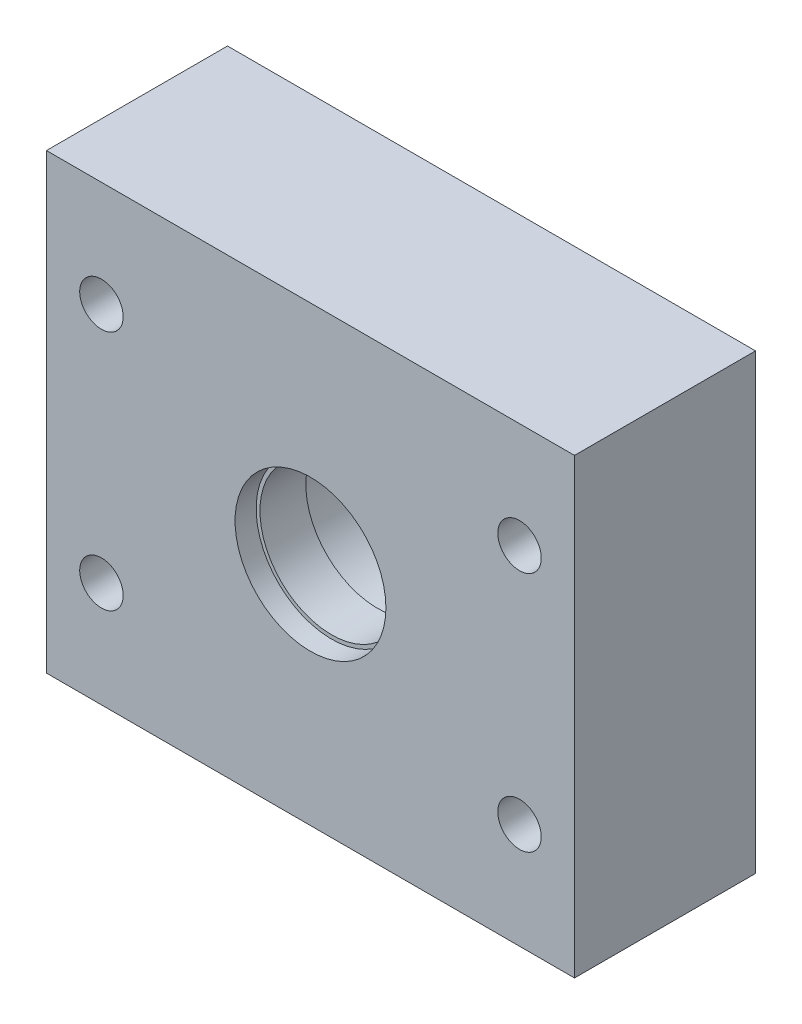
ISO-10303-21;
HEADER;
FILE_DESCRIPTION(('STEP AP214'),'2;1');
FILE_NAME('part.step','',(''),(''),'','','');
FILE_SCHEMA(('AUTOMOTIVE_DESIGN { 1 0 10303 214 1 1 1 1 }'));
ENDSEC;
DATA;
#1=APPLICATION_CONTEXT('core data for automotive mechanical design processes');
#2=APPLICATION_PROTOCOL_DEFINITION('international standard','automotive_design',2000,#1);
#3=PRODUCT_CONTEXT('',#1,'mechanical');
#4=PRODUCT('Part','Part','',(#3));
#5=PRODUCT_RELATED_PRODUCT_CATEGORY('part','',(#4));
#6=PRODUCT_DEFINITION_FORMATION('','',#4);
#7=PRODUCT_DEFINITION_CONTEXT('part definition',#1,'design');
#8=PRODUCT_DEFINITION('design','',#6,#7);
#9=PRODUCT_DEFINITION_SHAPE('','',#8);
#10=(LENGTH_UNIT() NAMED_UNIT(*) SI_UNIT(.MILLI.,.METRE.));
#11=(NAMED_UNIT(*) PLANE_ANGLE_UNIT() SI_UNIT($,.RADIAN.));
#12=(NAMED_UNIT(*) SI_UNIT($,.STERADIAN.) SOLID_ANGLE_UNIT());
#13=UNCERTAINTY_MEASURE_WITH_UNIT(LENGTH_MEASURE(1.E-05),#10,'distance_accuracy_value','');
#14=(GEOMETRIC_REPRESENTATION_CONTEXT(3) GLOBAL_UNCERTAINTY_ASSIGNED_CONTEXT((#13)) GLOBAL_UNIT_ASSIGNED_CONTEXT((#10,
#11,#12)) REPRESENTATION_CONTEXT('',''));
#15=CARTESIAN_POINT('',(0.,0.,0.));
#16=DIRECTION('',(0.,0.,1.));
#17=DIRECTION('',(1.,0.,0.));
#18=AXIS2_PLACEMENT_3D('',#15,#16,#17);
#19=CARTESIAN_POINT('',(22.225,19.05,0.));
#20=DIRECTION('',(0.,0.,1.));
#21=DIRECTION('',(1.,0.,0.));
#22=AXIS2_PLACEMENT_3D('',#19,#20,#21);
#23=CYLINDRICAL_SURFACE('',#22,6.0325);
#24=CARTESIAN_POINT('',(22.225,19.05,13.462));
#25=DIRECTION('',(0.,0.,1.));
#26=DIRECTION('',(1.,0.,0.));
#27=AXIS2_PLACEMENT_3D('',#24,#25,#26);
#28=CIRCLE('',#27,6.0325);
#29=CARTESIAN_POINT('',(28.2575,19.05,13.462));
#30=VERTEX_POINT('',#29);
#31=EDGE_CURVE('E108',#30,#30,#28,.F.);
#32=CARTESIAN_POINT('',(22.225,19.05,9.6012));
#33=DIRECTION('',(0.,0.,-1.));
#34=DIRECTION('',(-1.,0.,0.));
#35=AXIS2_PLACEMENT_3D('',#32,#33,#34);
#36=CIRCLE('',#35,6.0325);
#37=CARTESIAN_POINT('',(28.2575,19.05,9.6012));
#38=VERTEX_POINT('',#37);
#39=EDGE_CURVE('E33',#38,#38,#36,.F.);
#40=CARTESIAN_POINT('',(28.2575,19.05,13.462));
#41=CARTESIAN_POINT('',(28.2575,19.05,13.4217833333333));
#42=CARTESIAN_POINT('',(28.2575,19.05,13.3815666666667));
#43=CARTESIAN_POINT('',(28.2575,19.05,13.3011333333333));
#44=CARTESIAN_POINT('',(28.2575,19.05,13.2609166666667));
#45=CARTESIAN_POINT('',(28.2575,19.05,13.1804833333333));
#46=CARTESIAN_POINT('',(28.2575,19.05,13.1402666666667));
#47=CARTESIAN_POINT('',(28.2575,19.05,13.0598333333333));
#48=CARTESIAN_POINT('',(28.2575,19.05,13.0196166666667));
#49=CARTESIAN_POINT('',(28.2575,19.05,12.9391833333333));
#50=CARTESIAN_POINT('',(28.2575,19.05,12.8989666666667));
#51=CARTESIAN_POINT('',(28.2575,19.05,12.8185333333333));
#52=CARTESIAN_POINT('',(28.2575,19.05,12.7783166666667));
#53=CARTESIAN_POINT('',(28.2575,19.05,12.6978833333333));
#54=CARTESIAN_POINT('',(28.2575,19.05,12.6576666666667));
#55=CARTESIAN_POINT('',(28.2575,19.05,12.5772333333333));
#56=CARTESIAN_POINT('',(28.2575,19.05,12.5370166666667));
#57=CARTESIAN_POINT('',(28.2575,19.05,12.4565833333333));
#58=CARTESIAN_POINT('',(28.2575,19.05,12.4163666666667));
#59=CARTESIAN_POINT('',(28.2575,19.05,12.3359333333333));
#60=CARTESIAN_POINT('',(28.2575,19.05,12.2957166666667));
#61=CARTESIAN_POINT('',(28.2575,19.05,12.2152833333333));
#62=CARTESIAN_POINT('',(28.2575,19.05,12.1750666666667));
#63=CARTESIAN_POINT('',(28.2575,19.05,12.0946333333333));
#64=CARTESIAN_POINT('',(28.2575,19.05,12.0544166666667));
#65=CARTESIAN_POINT('',(28.2575,19.05,11.9739833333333));
#66=CARTESIAN_POINT('',(28.2575,19.05,11.9337666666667));
#67=CARTESIAN_POINT('',(28.2575,19.05,11.8533333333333));
#68=CARTESIAN_POINT('',(28.2575,19.05,11.8131166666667));
#69=CARTESIAN_POINT('',(28.2575,19.05,11.7326833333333));
#70=CARTESIAN_POINT('',(28.2575,19.05,11.6924666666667));
#71=CARTESIAN_POINT('',(28.2575,19.05,11.6120333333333));
#72=CARTESIAN_POINT('',(28.2575,19.05,11.5718166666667));
#73=CARTESIAN_POINT('',(28.2575,19.05,11.4913833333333));
#74=CARTESIAN_POINT('',(28.2575,19.05,11.4511666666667));
#75=CARTESIAN_POINT('',(28.2575,19.05,11.3707333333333));
#76=CARTESIAN_POINT('',(28.2575,19.05,11.3305166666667));
#77=CARTESIAN_POINT('',(28.2575,19.05,11.2500833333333));
#78=CARTESIAN_POINT('',(28.2575,19.05,11.2098666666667));
#79=CARTESIAN_POINT('',(28.2575,19.05,11.1294333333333));
#80=CARTESIAN_POINT('',(28.2575,19.05,11.0892166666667));
#81=CARTESIAN_POINT('',(28.2575,19.05,11.0087833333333));
#82=CARTESIAN_POINT('',(28.2575,19.05,10.9685666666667));
#83=CARTESIAN_POINT('',(28.2575,19.05,10.8881333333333));
#84=CARTESIAN_POINT('',(28.2575,19.05,10.8479166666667));
#85=CARTESIAN_POINT('',(28.2575,19.05,10.7674833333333));
#86=CARTESIAN_POINT('',(28.2575,19.05,10.7272666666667));
#87=CARTESIAN_POINT('',(28.2575,19.05,10.6468333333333));
#88=CARTESIAN_POINT('',(28.2575,19.05,10.6066166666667));
#89=CARTESIAN_POINT('',(28.2575,19.05,10.5261833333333));
#90=CARTESIAN_POINT('',(28.2575,19.05,10.4859666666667));
#91=CARTESIAN_POINT('',(28.2575,19.05,10.4055333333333));
#92=CARTESIAN_POINT('',(28.2575,19.05,10.3653166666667));
#93=CARTESIAN_POINT('',(28.2575,19.05,10.2848833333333));
#94=CARTESIAN_POINT('',(28.2575,19.05,10.2446666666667));
#95=CARTESIAN_POINT('',(28.2575,19.05,10.1642333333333));
#96=CARTESIAN_POINT('',(28.2575,19.05,10.1240166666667));
#97=CARTESIAN_POINT('',(28.2575,19.05,10.0435833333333));
#98=CARTESIAN_POINT('',(28.2575,19.05,10.0033666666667));
#99=CARTESIAN_POINT('',(28.2575,19.05,9.92293333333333));
#100=CARTESIAN_POINT('',(28.2575,19.05,9.88271666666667));
#101=CARTESIAN_POINT('',(28.2575,19.05,9.80228333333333));
#102=CARTESIAN_POINT('',(28.2575,19.05,9.76206666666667));
#103=CARTESIAN_POINT('',(28.2575,19.05,9.68163333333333));
#104=CARTESIAN_POINT('',(28.2575,19.05,9.64141666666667));
#105=CARTESIAN_POINT('',(28.2575,19.05,9.6012));
#106=B_SPLINE_CURVE_WITH_KNOTS('',3,(#40,#41,#42,#43,#44,#45,#46,#47,#48,#49,#50,#51,#52,#53,
#54,#55,#56,#57,#58,#59,#60,#61,#62,#63,#64,#65,#66,#67,#68,#69,#70,#71,#72,#73,#74,#75,#76,#77,
#78,#79,#80,#81,#82,#83,#84,#85,#86,#87,#88,#89,#90,#91,#92,#93,#94,#95,#96,#97,#98,#99,#100,
#101,#102,#103,#104,#105),.UNSPECIFIED.,.F.,.F.,(4,2,2,2,2,2,2,2,2,2,2,2,2,2,2,2,2,2,2,2,2,2,2,
2,2,2,2,2,2,2,2,2,4),(0.,0.12065,0.2413,0.36195,0.4826,0.60325,0.7239,0.844549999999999,
0.965199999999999,1.08585,1.2065,1.32715,1.4478,1.56845,1.6891,1.80975,1.9304,2.05105,2.1717,
2.29235,2.413,2.53365,2.6543,2.77495,2.8956,3.01625,3.1369,3.25755,3.3782,3.49885,3.6195,
3.74015,3.8608),.UNSPECIFIED.);
#107=EDGE_CURVE('BSEAM29',#30,#38,#106,.T.);
#108=ORIENTED_EDGE('',*,*,#31,.F.);
#109=ORIENTED_EDGE('',*,*,#39,.F.);
#110=ORIENTED_EDGE('',*,*,#107,.T.);
#111=ORIENTED_EDGE('',*,*,#107,.F.);
#112=EDGE_LOOP('',(#108,#110,#109,#111));
#113=FACE_BOUND('',#112,.T.);
#114=ADVANCED_FACE('F29',(#113),#23,.F.);
#115=CARTESIAN_POINT('',(0.,0.,15.24));
#116=DIRECTION('',(1.,0.,0.));
#117=DIRECTION('',(0.,1.,0.));
#118=AXIS2_PLACEMENT_3D('',#115,#116,#117);
#119=PLANE('',#118);
#120=DIRECTION('',(0.,-1.,0.));
#121=VECTOR('',#120,1.);
#122=CARTESIAN_POINT('',(0.,0.,0.));
#123=LINE('',#122,#121);
#124=CARTESIAN_POINT('',(0.,38.1,0.));
#125=VERTEX_POINT('',#124);
#126=CARTESIAN_POINT('',(0.,0.,0.));
#127=VERTEX_POINT('',#126);
#128=EDGE_CURVE('E76',#125,#127,#123,.T.);
#129=ORIENTED_EDGE('',*,*,#128,.T.);
#130=DIRECTION('',(0.,0.,-1.));
#131=VECTOR('',#130,1.);
#132=CARTESIAN_POINT('',(0.,0.,15.24));
#133=LINE('',#132,#131);
#134=CARTESIAN_POINT('',(0.,0.,15.24));
#135=VERTEX_POINT('',#134);
#136=EDGE_CURVE('E11',#135,#127,#133,.T.);
#137=ORIENTED_EDGE('',*,*,#136,.F.);
#138=DIRECTION('',(0.,-1.,0.));
#139=VECTOR('',#138,1.);
#140=CARTESIAN_POINT('',(0.,0.,15.24));
#141=LINE('',#140,#139);
#142=CARTESIAN_POINT('',(0.,38.1,15.24));
#143=VERTEX_POINT('',#142);
#144=EDGE_CURVE('E99',#143,#135,#141,.T.);
#145=ORIENTED_EDGE('',*,*,#144,.F.);
#146=DIRECTION('',(0.,0.,-1.));
#147=VECTOR('',#146,1.);
#148=CARTESIAN_POINT('',(0.,38.1,15.24));
#149=LINE('',#148,#147);
#150=EDGE_CURVE('E88',#143,#125,#149,.T.);
#151=ORIENTED_EDGE('',*,*,#150,.T.);
#152=EDGE_LOOP('',(#129,#137,#145,#151));
#153=FACE_BOUND('',#152,.T.);
#154=ADVANCED_FACE('F31',(#153),#119,.F.);
#155=CARTESIAN_POINT('',(0.,0.,15.24));
#156=DIRECTION('',(0.,1.,0.));
#157=DIRECTION('',(0.,0.,1.));
#158=AXIS2_PLACEMENT_3D('',#155,#156,#157);
#159=PLANE('',#158);
#160=DIRECTION('',(1.,0.,0.));
#161=VECTOR('',#160,1.);
#162=CARTESIAN_POINT('',(0.,0.,0.));
#163=LINE('',#162,#161);
#164=CARTESIAN_POINT('',(44.45,0.,0.));
#165=VERTEX_POINT('',#164);
#166=EDGE_CURVE('E72',#127,#165,#163,.T.);
#167=ORIENTED_EDGE('',*,*,#166,.T.);
#168=DIRECTION('',(0.,0.,-1.));
#169=VECTOR('',#168,1.);
#170=CARTESIAN_POINT('',(44.45,0.,15.24));
#171=LINE('',#170,#169);
#172=CARTESIAN_POINT('',(44.45,0.,15.24));
#173=VERTEX_POINT('',#172);
#174=EDGE_CURVE('E38',#173,#165,#171,.T.);
#175=ORIENTED_EDGE('',*,*,#174,.F.);
#176=DIRECTION('',(1.,0.,0.));
#177=VECTOR('',#176,1.);
#178=CARTESIAN_POINT('',(0.,0.,15.24));
#179=LINE('',#178,#177);
#180=EDGE_CURVE('E84',#135,#173,#179,.T.);
#181=ORIENTED_EDGE('',*,*,#180,.F.);
#182=ORIENTED_EDGE('',*,*,#136,.T.);
#183=EDGE_LOOP('',(#167,#175,#181,#182));
#184=FACE_BOUND('',#183,.T.);
#185=ADVANCED_FACE('F83',(#184),#159,.F.);
#186=CARTESIAN_POINT('',(44.45,0.,15.24));
#187=DIRECTION('',(-1.,0.,0.));
#188=DIRECTION('',(0.,-1.,0.));
#189=AXIS2_PLACEMENT_3D('',#186,#187,#188);
#190=PLANE('',#189);
#191=DIRECTION('',(0.,1.,0.));
#192=VECTOR('',#191,1.);
#193=CARTESIAN_POINT('',(44.45,0.,0.));
#194=LINE('',#193,#192);
#195=CARTESIAN_POINT('',(44.45,38.1,0.));
#196=VERTEX_POINT('',#195);
#197=EDGE_CURVE('E77',#165,#196,#194,.T.);
#198=ORIENTED_EDGE('',*,*,#197,.T.);
#199=DIRECTION('',(0.,0.,-1.));
#200=VECTOR('',#199,1.);
#201=CARTESIAN_POINT('',(44.45,38.1,15.24));
#202=LINE('',#201,#200);
#203=CARTESIAN_POINT('',(44.45,38.1,15.24));
#204=VERTEX_POINT('',#203);
#205=EDGE_CURVE('E105',#204,#196,#202,.T.);
#206=ORIENTED_EDGE('',*,*,#205,.F.);
#207=DIRECTION('',(0.,1.,0.));
#208=VECTOR('',#207,1.);
#209=CARTESIAN_POINT('',(44.45,0.,15.24));
#210=LINE('',#209,#208);
#211=EDGE_CURVE('E51',#173,#204,#210,.T.);
#212=ORIENTED_EDGE('',*,*,#211,.F.);
#213=ORIENTED_EDGE('',*,*,#174,.T.);
#214=EDGE_LOOP('',(#198,#206,#212,#213));
#215=FACE_BOUND('',#214,.T.);
#216=ADVANCED_FACE('F150',(#215),#190,.F.);
#217=CARTESIAN_POINT('',(0.,38.1,15.24));
#218=DIRECTION('',(0.,-1.,0.));
#219=DIRECTION('',(0.,0.,-1.));
#220=AXIS2_PLACEMENT_3D('',#217,#218,#219);
#221=PLANE('',#220);
#222=DIRECTION('',(-1.,0.,0.));
#223=VECTOR('',#222,1.);
#224=CARTESIAN_POINT('',(0.,38.1,0.));
#225=LINE('',#224,#223);
#226=EDGE_CURVE('E97',#196,#125,#225,.T.);
#227=ORIENTED_EDGE('',*,*,#226,.T.);
#228=ORIENTED_EDGE('',*,*,#150,.F.);
#229=DIRECTION('',(-1.,0.,0.));
#230=VECTOR('',#229,1.);
#231=CARTESIAN_POINT('',(0.,38.1,15.24));
#232=LINE('',#231,#230);
#233=EDGE_CURVE('E46',#204,#143,#232,.T.);
#234=ORIENTED_EDGE('',*,*,#233,.F.);
#235=ORIENTED_EDGE('',*,*,#205,.T.);
#236=EDGE_LOOP('',(#227,#228,#234,#235));
#237=FACE_BOUND('',#236,.T.);
#238=ADVANCED_FACE('F146',(#237),#221,.F.);
#239=CARTESIAN_POINT('',(0.,38.1,15.24));
#240=DIRECTION('',(0.,0.,-1.));
#241=DIRECTION('',(-1.,0.,0.));
#242=AXIS2_PLACEMENT_3D('',#239,#240,#241);
#243=PLANE('',#242);
#244=CARTESIAN_POINT('',(22.225,19.05,15.24));
#245=DIRECTION('',(0.,0.,1.));
#246=DIRECTION('',(1.,0.,0.));
#247=AXIS2_PLACEMENT_3D('',#244,#245,#246);
#248=CIRCLE('',#247,6.35);
#249=CARTESIAN_POINT('',(28.575,19.05,15.24));
#250=VERTEX_POINT('',#249);
#251=EDGE_CURVE('E118',#250,#250,#248,.T.);
#252=ORIENTED_EDGE('',*,*,#251,.F.);
#253=EDGE_LOOP('',(#252));
#254=FACE_BOUND('',#253,.T.);
#255=CARTESIAN_POINT('',(39.8226362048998,8.88999999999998,15.24));
#256=DIRECTION('',(0.,0.,1.));
#257=DIRECTION('',(1.,0.,0.));
#258=AXIS2_PLACEMENT_3D('',#255,#256,#257);
#259=CIRCLE('',#258,1.8288);
#260=CARTESIAN_POINT('',(41.6514362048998,8.88999999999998,15.24));
#261=VERTEX_POINT('',#260);
#262=EDGE_CURVE('E110',#261,#261,#259,.T.);
#263=ORIENTED_EDGE('',*,*,#262,.F.);
#264=EDGE_LOOP('',(#263));
#265=FACE_BOUND('',#264,.T.);
#266=CARTESIAN_POINT('',(39.8226362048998,29.21,15.24));
#267=DIRECTION('',(0.,0.,1.));
#268=DIRECTION('',(1.,0.,0.));
#269=AXIS2_PLACEMENT_3D('',#266,#267,#268);
#270=CIRCLE('',#269,1.8288);
#271=CARTESIAN_POINT('',(41.6514362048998,29.21,15.24));
#272=VERTEX_POINT('',#271);
#273=EDGE_CURVE('E128',#272,#272,#270,.T.);
#274=ORIENTED_EDGE('',*,*,#273,.F.);
#275=EDGE_LOOP('',(#274));
#276=FACE_BOUND('',#275,.T.);
#277=CARTESIAN_POINT('',(4.62736379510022,29.21,15.24));
#278=DIRECTION('',(0.,0.,1.));
#279=DIRECTION('',(1.,0.,0.));
#280=AXIS2_PLACEMENT_3D('',#277,#278,#279);
#281=CIRCLE('',#280,1.8288);
#282=CARTESIAN_POINT('',(6.45616379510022,29.21,15.24));
#283=VERTEX_POINT('',#282);
#284=EDGE_CURVE('E134',#283,#283,#281,.T.);
#285=ORIENTED_EDGE('',*,*,#284,.F.);
#286=EDGE_LOOP('',(#285));
#287=FACE_BOUND('',#286,.T.);
#288=CARTESIAN_POINT('',(4.62736379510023,8.88999999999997,15.24));
#289=DIRECTION('',(0.,0.,1.));
#290=DIRECTION('',(1.,0.,0.));
#291=AXIS2_PLACEMENT_3D('',#288,#289,#290);
#292=CIRCLE('',#291,1.8288);
#293=CARTESIAN_POINT('',(6.45616379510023,8.88999999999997,15.24));
#294=VERTEX_POINT('',#293);
#295=EDGE_CURVE('E92',#294,#294,#292,.T.);
#296=ORIENTED_EDGE('',*,*,#295,.F.);
#297=EDGE_LOOP('',(#296));
#298=FACE_BOUND('',#297,.T.);
#299=ORIENTED_EDGE('',*,*,#144,.T.);
#300=ORIENTED_EDGE('',*,*,#180,.T.);
#301=ORIENTED_EDGE('',*,*,#211,.T.);
#302=ORIENTED_EDGE('',*,*,#233,.T.);
#303=EDGE_LOOP('',(#299,#300,#301,#302));
#304=FACE_BOUND('',#303,.T.);
#305=ADVANCED_FACE('F144',(#254,#265,#276,#287,#298,#304),#243,.F.);
#306=CARTESIAN_POINT('',(0.,38.1,0.));
#307=DIRECTION('',(0.,0.,-1.));
#308=DIRECTION('',(-1.,0.,0.));
#309=AXIS2_PLACEMENT_3D('',#306,#307,#308);
#310=PLANE('',#309);
#311=CARTESIAN_POINT('',(22.225,19.05,0.));
#312=DIRECTION('',(0.,0.,-1.));
#313=DIRECTION('',(-1.,0.,0.));
#314=AXIS2_PLACEMENT_3D('',#311,#312,#313);
#315=CIRCLE('',#314,6.35);
#316=CARTESIAN_POINT('',(15.875,19.05,0.));
#317=VERTEX_POINT('',#316);
#318=EDGE_CURVE('E194',#317,#317,#315,.T.);
#319=ORIENTED_EDGE('',*,*,#318,.F.);
#320=EDGE_LOOP('',(#319));
#321=FACE_BOUND('',#320,.T.);
#322=CARTESIAN_POINT('',(39.8226362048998,8.88999999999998,0.));
#323=DIRECTION('',(0.,0.,1.));
#324=DIRECTION('',(1.,0.,0.));
#325=AXIS2_PLACEMENT_3D('',#322,#323,#324);
#326=CIRCLE('',#325,1.8288);
#327=CARTESIAN_POINT('',(41.6514362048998,8.88999999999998,0.));
#328=VERTEX_POINT('',#327);
#329=EDGE_CURVE('E115',#328,#328,#326,.T.);
#330=ORIENTED_EDGE('',*,*,#329,.T.);
#331=EDGE_LOOP('',(#330));
#332=FACE_BOUND('',#331,.T.);
#333=CARTESIAN_POINT('',(39.8226362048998,29.21,0.));
#334=DIRECTION('',(0.,0.,1.));
#335=DIRECTION('',(1.,0.,0.));
#336=AXIS2_PLACEMENT_3D('',#333,#334,#335);
#337=CIRCLE('',#336,1.8288);
#338=CARTESIAN_POINT('',(41.6514362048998,29.21,0.));
#339=VERTEX_POINT('',#338);
#340=EDGE_CURVE('E131',#339,#339,#337,.T.);
#341=ORIENTED_EDGE('',*,*,#340,.T.);
#342=EDGE_LOOP('',(#341));
#343=FACE_BOUND('',#342,.T.);
#344=CARTESIAN_POINT('',(4.62736379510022,29.21,0.));
#345=DIRECTION('',(0.,0.,1.));
#346=DIRECTION('',(1.,0.,0.));
#347=AXIS2_PLACEMENT_3D('',#344,#345,#346);
#348=CIRCLE('',#347,1.8288);
#349=CARTESIAN_POINT('',(6.45616379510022,29.21,0.));
#350=VERTEX_POINT('',#349);
#351=EDGE_CURVE('E137',#350,#350,#348,.T.);
#352=ORIENTED_EDGE('',*,*,#351,.T.);
#353=EDGE_LOOP('',(#352));
#354=FACE_BOUND('',#353,.T.);
#355=CARTESIAN_POINT('',(4.62736379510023,8.88999999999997,0.));
#356=DIRECTION('',(0.,0.,1.));
#357=DIRECTION('',(1.,0.,0.));
#358=AXIS2_PLACEMENT_3D('',#355,#356,#357);
#359=CIRCLE('',#358,1.8288);
#360=CARTESIAN_POINT('',(6.45616379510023,8.88999999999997,0.));
#361=VERTEX_POINT('',#360);
#362=EDGE_CURVE('E89',#361,#361,#359,.T.);
#363=ORIENTED_EDGE('',*,*,#362,.T.);
#364=EDGE_LOOP('',(#363));
#365=FACE_BOUND('',#364,.T.);
#366=ORIENTED_EDGE('',*,*,#128,.F.);
#367=ORIENTED_EDGE('',*,*,#226,.F.);
#368=ORIENTED_EDGE('',*,*,#197,.F.);
#369=ORIENTED_EDGE('',*,*,#166,.F.);
#370=EDGE_LOOP('',(#366,#367,#368,#369));
#371=FACE_BOUND('',#370,.T.);
#372=ADVANCED_FACE('F73',(#321,#332,#343,#354,#365,#371),#310,.T.);
#373=CARTESIAN_POINT('',(4.62736379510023,8.88999999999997,0.));
#374=DIRECTION('',(0.,0.,1.));
#375=DIRECTION('',(1.,0.,0.));
#376=AXIS2_PLACEMENT_3D('',#373,#374,#375);
#377=CYLINDRICAL_SURFACE('',#376,1.8288);
#378=CARTESIAN_POINT('',(6.45616379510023,8.88999999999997,0.));
#379=CARTESIAN_POINT('',(6.45616379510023,8.88999999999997,0.15875));
#380=CARTESIAN_POINT('',(6.45616379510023,8.88999999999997,0.3175));
#381=CARTESIAN_POINT('',(6.45616379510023,8.88999999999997,0.635));
#382=CARTESIAN_POINT('',(6.45616379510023,8.88999999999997,0.79375));
#383=CARTESIAN_POINT('',(6.45616379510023,8.88999999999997,1.11125));
#384=CARTESIAN_POINT('',(6.45616379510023,8.88999999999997,1.27));
#385=CARTESIAN_POINT('',(6.45616379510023,8.88999999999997,1.5875));
#386=CARTESIAN_POINT('',(6.45616379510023,8.88999999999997,1.74625));
#387=CARTESIAN_POINT('',(6.45616379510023,8.88999999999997,2.06375));
#388=CARTESIAN_POINT('',(6.45616379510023,8.88999999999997,2.2225));
#389=CARTESIAN_POINT('',(6.45616379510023,8.88999999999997,2.54));
#390=CARTESIAN_POINT('',(6.45616379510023,8.88999999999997,2.69875));
#391=CARTESIAN_POINT('',(6.45616379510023,8.88999999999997,3.01625));
#392=CARTESIAN_POINT('',(6.45616379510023,8.88999999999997,3.175));
#393=CARTESIAN_POINT('',(6.45616379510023,8.88999999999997,3.4925));
#394=CARTESIAN_POINT('',(6.45616379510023,8.88999999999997,3.65125));
#395=CARTESIAN_POINT('',(6.45616379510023,8.88999999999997,3.96875));
#396=CARTESIAN_POINT('',(6.45616379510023,8.88999999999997,4.1275));
#397=CARTESIAN_POINT('',(6.45616379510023,8.88999999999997,4.445));
#398=CARTESIAN_POINT('',(6.45616379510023,8.88999999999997,4.60375));
#399=CARTESIAN_POINT('',(6.45616379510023,8.88999999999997,4.92125));
#400=CARTESIAN_POINT('',(6.45616379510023,8.88999999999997,5.08));
#401=CARTESIAN_POINT('',(6.45616379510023,8.88999999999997,5.3975));
#402=CARTESIAN_POINT('',(6.45616379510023,8.88999999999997,5.55625));
#403=CARTESIAN_POINT('',(6.45616379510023,8.88999999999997,5.87375));
#404=CARTESIAN_POINT('',(6.45616379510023,8.88999999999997,6.0325));
#405=CARTESIAN_POINT('',(6.45616379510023,8.88999999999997,6.35));
#406=CARTESIAN_POINT('',(6.45616379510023,8.88999999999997,6.50875));
#407=CARTESIAN_POINT('',(6.45616379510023,8.88999999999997,6.82625));
#408=CARTESIAN_POINT('',(6.45616379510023,8.88999999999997,6.985));
#409=CARTESIAN_POINT('',(6.45616379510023,8.88999999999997,7.3025));
#410=CARTESIAN_POINT('',(6.45616379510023,8.88999999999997,7.46125));
#411=CARTESIAN_POINT('',(6.45616379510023,8.88999999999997,7.77875));
#412=CARTESIAN_POINT('',(6.45616379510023,8.88999999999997,7.9375));
#413=CARTESIAN_POINT('',(6.45616379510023,8.88999999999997,8.255));
#414=CARTESIAN_POINT('',(6.45616379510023,8.88999999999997,8.41375));
#415=CARTESIAN_POINT('',(6.45616379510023,8.88999999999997,8.73125));
#416=CARTESIAN_POINT('',(6.45616379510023,8.88999999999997,8.89));
#417=CARTESIAN_POINT('',(6.45616379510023,8.88999999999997,9.2075));
#418=CARTESIAN_POINT('',(6.45616379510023,8.88999999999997,9.36625));
#419=CARTESIAN_POINT('',(6.45616379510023,8.88999999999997,9.68375));
#420=CARTESIAN_POINT('',(6.45616379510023,8.88999999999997,9.8425));
#421=CARTESIAN_POINT('',(6.45616379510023,8.88999999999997,10.16));
#422=CARTESIAN_POINT('',(6.45616379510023,8.88999999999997,10.31875));
#423=CARTESIAN_POINT('',(6.45616379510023,8.88999999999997,10.63625));
#424=CARTESIAN_POINT('',(6.45616379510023,8.88999999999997,10.795));
#425=CARTESIAN_POINT('',(6.45616379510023,8.88999999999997,11.1125));
#426=CARTESIAN_POINT('',(6.45616379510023,8.88999999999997,11.27125));
#427=CARTESIAN_POINT('',(6.45616379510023,8.88999999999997,11.58875));
#428=CARTESIAN_POINT('',(6.45616379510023,8.88999999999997,11.7475));
#429=CARTESIAN_POINT('',(6.45616379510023,8.88999999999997,12.065));
#430=CARTESIAN_POINT('',(6.45616379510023,8.88999999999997,12.22375));
#431=CARTESIAN_POINT('',(6.45616379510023,8.88999999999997,12.54125));
#432=CARTESIAN_POINT('',(6.45616379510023,8.88999999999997,12.7));
#433=CARTESIAN_POINT('',(6.45616379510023,8.88999999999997,13.0175));
#434=CARTESIAN_POINT('',(6.45616379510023,8.88999999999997,13.17625));
#435=CARTESIAN_POINT('',(6.45616379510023,8.88999999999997,13.49375));
#436=CARTESIAN_POINT('',(6.45616379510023,8.88999999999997,13.6525));
#437=CARTESIAN_POINT('',(6.45616379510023,8.88999999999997,13.97));
#438=CARTESIAN_POINT('',(6.45616379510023,8.88999999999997,14.12875));
#439=CARTESIAN_POINT('',(6.45616379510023,8.88999999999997,14.44625));
#440=CARTESIAN_POINT('',(6.45616379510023,8.88999999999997,14.605));
#441=CARTESIAN_POINT('',(6.45616379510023,8.88999999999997,14.9225));
#442=CARTESIAN_POINT('',(6.45616379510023,8.88999999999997,15.08125));
#443=CARTESIAN_POINT('',(6.45616379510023,8.88999999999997,15.24));
#444=B_SPLINE_CURVE_WITH_KNOTS('',3,(#378,#379,#380,#381,#382,#383,#384,#385,#386,#387,#388,
#389,#390,#391,#392,#393,#394,#395,#396,#397,#398,#399,#400,#401,#402,#403,#404,#405,#406,#407,
#408,#409,#410,#411,#412,#413,#414,#415,#416,#417,#418,#419,#420,#421,#422,#423,#424,#425,#426,
#427,#428,#429,#430,#431,#432,#433,#434,#435,#436,#437,#438,#439,#440,#441,#442,#443),
.UNSPECIFIED.,.F.,.F.,(4,2,2,2,2,2,2,2,2,2,2,2,2,2,2,2,2,2,2,2,2,2,2,2,2,2,2,2,2,2,2,2,4),(0.,
0.47625,0.9525,1.42875,1.905,2.38125,2.8575,3.33375,3.81,4.28625,4.7625,5.23875,5.715,6.19125,
6.6675,7.14375,7.62,8.09625,8.5725,9.04875,9.525,10.00125,10.4775,10.95375,11.43,11.90625,
12.3825,12.85875,13.335,13.81125,14.2875,14.76375,15.24),.UNSPECIFIED.);
#445=EDGE_CURVE('BSEAM142',#361,#294,#444,.T.);
#446=ORIENTED_EDGE('',*,*,#362,.F.);
#447=ORIENTED_EDGE('',*,*,#295,.T.);
#448=ORIENTED_EDGE('',*,*,#445,.T.);
#449=ORIENTED_EDGE('',*,*,#445,.F.);
#450=EDGE_LOOP('',(#446,#448,#447,#449));
#451=FACE_BOUND('',#450,.T.);
#452=ADVANCED_FACE('F142',(#451),#377,.F.);
#453=CARTESIAN_POINT('',(4.62736379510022,29.21,0.));
#454=DIRECTION('',(0.,0.,1.));
#455=DIRECTION('',(1.,0.,0.));
#456=AXIS2_PLACEMENT_3D('',#453,#454,#455);
#457=CYLINDRICAL_SURFACE('',#456,1.8288);
#458=CARTESIAN_POINT('',(6.45616379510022,29.21,0.));
#459=CARTESIAN_POINT('',(6.45616379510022,29.21,0.15875));
#460=CARTESIAN_POINT('',(6.45616379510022,29.21,0.3175));
#461=CARTESIAN_POINT('',(6.45616379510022,29.21,0.635));
#462=CARTESIAN_POINT('',(6.45616379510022,29.21,0.79375));
#463=CARTESIAN_POINT('',(6.45616379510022,29.21,1.11125));
#464=CARTESIAN_POINT('',(6.45616379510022,29.21,1.27));
#465=CARTESIAN_POINT('',(6.45616379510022,29.21,1.5875));
#466=CARTESIAN_POINT('',(6.45616379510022,29.21,1.74625));
#467=CARTESIAN_POINT('',(6.45616379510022,29.21,2.06375));
#468=CARTESIAN_POINT('',(6.45616379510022,29.21,2.2225));
#469=CARTESIAN_POINT('',(6.45616379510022,29.21,2.54));
#470=CARTESIAN_POINT('',(6.45616379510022,29.21,2.69875));
#471=CARTESIAN_POINT('',(6.45616379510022,29.21,3.01625));
#472=CARTESIAN_POINT('',(6.45616379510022,29.21,3.175));
#473=CARTESIAN_POINT('',(6.45616379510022,29.21,3.4925));
#474=CARTESIAN_POINT('',(6.45616379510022,29.21,3.65125));
#475=CARTESIAN_POINT('',(6.45616379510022,29.21,3.96875));
#476=CARTESIAN_POINT('',(6.45616379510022,29.21,4.1275));
#477=CARTESIAN_POINT('',(6.45616379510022,29.21,4.445));
#478=CARTESIAN_POINT('',(6.45616379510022,29.21,4.60375));
#479=CARTESIAN_POINT('',(6.45616379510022,29.21,4.92125));
#480=CARTESIAN_POINT('',(6.45616379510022,29.21,5.08));
#481=CARTESIAN_POINT('',(6.45616379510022,29.21,5.3975));
#482=CARTESIAN_POINT('',(6.45616379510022,29.21,5.55625));
#483=CARTESIAN_POINT('',(6.45616379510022,29.21,5.87375));
#484=CARTESIAN_POINT('',(6.45616379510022,29.21,6.0325));
#485=CARTESIAN_POINT('',(6.45616379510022,29.21,6.35));
#486=CARTESIAN_POINT('',(6.45616379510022,29.21,6.50875));
#487=CARTESIAN_POINT('',(6.45616379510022,29.21,6.82625));
#488=CARTESIAN_POINT('',(6.45616379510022,29.21,6.985));
#489=CARTESIAN_POINT('',(6.45616379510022,29.21,7.3025));
#490=CARTESIAN_POINT('',(6.45616379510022,29.21,7.46125));
#491=CARTESIAN_POINT('',(6.45616379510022,29.21,7.77875));
#492=CARTESIAN_POINT('',(6.45616379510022,29.21,7.9375));
#493=CARTESIAN_POINT('',(6.45616379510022,29.21,8.255));
#494=CARTESIAN_POINT('',(6.45616379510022,29.21,8.41375));
#495=CARTESIAN_POINT('',(6.45616379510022,29.21,8.73125));
#496=CARTESIAN_POINT('',(6.45616379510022,29.21,8.89));
#497=CARTESIAN_POINT('',(6.45616379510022,29.21,9.2075));
#498=CARTESIAN_POINT('',(6.45616379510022,29.21,9.36625));
#499=CARTESIAN_POINT('',(6.45616379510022,29.21,9.68375));
#500=CARTESIAN_POINT('',(6.45616379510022,29.21,9.8425));
#501=CARTESIAN_POINT('',(6.45616379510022,29.21,10.16));
#502=CARTESIAN_POINT('',(6.45616379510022,29.21,10.31875));
#503=CARTESIAN_POINT('',(6.45616379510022,29.21,10.63625));
#504=CARTESIAN_POINT('',(6.45616379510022,29.21,10.795));
#505=CARTESIAN_POINT('',(6.45616379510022,29.21,11.1125));
#506=CARTESIAN_POINT('',(6.45616379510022,29.21,11.27125));
#507=CARTESIAN_POINT('',(6.45616379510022,29.21,11.58875));
#508=CARTESIAN_POINT('',(6.45616379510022,29.21,11.7475));
#509=CARTESIAN_POINT('',(6.45616379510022,29.21,12.065));
#510=CARTESIAN_POINT('',(6.45616379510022,29.21,12.22375));
#511=CARTESIAN_POINT('',(6.45616379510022,29.21,12.54125));
#512=CARTESIAN_POINT('',(6.45616379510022,29.21,12.7));
#513=CARTESIAN_POINT('',(6.45616379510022,29.21,13.0175));
#514=CARTESIAN_POINT('',(6.45616379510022,29.21,13.17625));
#515=CARTESIAN_POINT('',(6.45616379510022,29.21,13.49375));
#516=CARTESIAN_POINT('',(6.45616379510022,29.21,13.6525));
#517=CARTESIAN_POINT('',(6.45616379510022,29.21,13.97));
#518=CARTESIAN_POINT('',(6.45616379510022,29.21,14.12875));
#519=CARTESIAN_POINT('',(6.45616379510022,29.21,14.44625));
#520=CARTESIAN_POINT('',(6.45616379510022,29.21,14.605));
#521=CARTESIAN_POINT('',(6.45616379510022,29.21,14.9225));
#522=CARTESIAN_POINT('',(6.45616379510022,29.21,15.08125));
#523=CARTESIAN_POINT('',(6.45616379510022,29.21,15.24));
#524=B_SPLINE_CURVE_WITH_KNOTS('',3,(#458,#459,#460,#461,#462,#463,#464,#465,#466,#467,#468,
#469,#470,#471,#472,#473,#474,#475,#476,#477,#478,#479,#480,#481,#482,#483,#484,#485,#486,#487,
#488,#489,#490,#491,#492,#493,#494,#495,#496,#497,#498,#499,#500,#501,#502,#503,#504,#505,#506,
#507,#508,#509,#510,#511,#512,#513,#514,#515,#516,#517,#518,#519,#520,#521,#522,#523),
.UNSPECIFIED.,.F.,.F.,(4,2,2,2,2,2,2,2,2,2,2,2,2,2,2,2,2,2,2,2,2,2,2,2,2,2,2,2,2,2,2,2,4),(0.,
0.47625,0.9525,1.42875,1.905,2.38125,2.8575,3.33375,3.81,4.28625,4.7625,5.23875,5.715,6.19125,
6.6675,7.14375,7.62,8.09625,8.5725,9.04875,9.525,10.00125,10.4775,10.95375,11.43,11.90625,
12.3825,12.85875,13.335,13.81125,14.2875,14.76375,15.24),.UNSPECIFIED.);
#525=EDGE_CURVE('BSEAM180',#350,#283,#524,.T.);
#526=ORIENTED_EDGE('',*,*,#351,.F.);
#527=ORIENTED_EDGE('',*,*,#284,.T.);
#528=ORIENTED_EDGE('',*,*,#525,.T.);
#529=ORIENTED_EDGE('',*,*,#525,.F.);
#530=EDGE_LOOP('',(#526,#528,#527,#529));
#531=FACE_BOUND('',#530,.T.);
#532=ADVANCED_FACE('F180',(#531),#457,.F.);
#533=CARTESIAN_POINT('',(39.8226362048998,29.21,0.));
#534=DIRECTION('',(0.,0.,1.));
#535=DIRECTION('',(1.,0.,0.));
#536=AXIS2_PLACEMENT_3D('',#533,#534,#535);
#537=CYLINDRICAL_SURFACE('',#536,1.8288);
#538=CARTESIAN_POINT('',(41.6514362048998,29.21,0.));
#539=CARTESIAN_POINT('',(41.6514362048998,29.21,0.15875));
#540=CARTESIAN_POINT('',(41.6514362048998,29.21,0.3175));
#541=CARTESIAN_POINT('',(41.6514362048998,29.21,0.635));
#542=CARTESIAN_POINT('',(41.6514362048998,29.21,0.79375));
#543=CARTESIAN_POINT('',(41.6514362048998,29.21,1.11125));
#544=CARTESIAN_POINT('',(41.6514362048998,29.21,1.27));
#545=CARTESIAN_POINT('',(41.6514362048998,29.21,1.5875));
#546=CARTESIAN_POINT('',(41.6514362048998,29.21,1.74625));
#547=CARTESIAN_POINT('',(41.6514362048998,29.21,2.06375));
#548=CARTESIAN_POINT('',(41.6514362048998,29.21,2.2225));
#549=CARTESIAN_POINT('',(41.6514362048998,29.21,2.54));
#550=CARTESIAN_POINT('',(41.6514362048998,29.21,2.69875));
#551=CARTESIAN_POINT('',(41.6514362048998,29.21,3.01625));
#552=CARTESIAN_POINT('',(41.6514362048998,29.21,3.175));
#553=CARTESIAN_POINT('',(41.6514362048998,29.21,3.4925));
#554=CARTESIAN_POINT('',(41.6514362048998,29.21,3.65125));
#555=CARTESIAN_POINT('',(41.6514362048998,29.21,3.96875));
#556=CARTESIAN_POINT('',(41.6514362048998,29.21,4.1275));
#557=CARTESIAN_POINT('',(41.6514362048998,29.21,4.445));
#558=CARTESIAN_POINT('',(41.6514362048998,29.21,4.60375));
#559=CARTESIAN_POINT('',(41.6514362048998,29.21,4.92125));
#560=CARTESIAN_POINT('',(41.6514362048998,29.21,5.08));
#561=CARTESIAN_POINT('',(41.6514362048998,29.21,5.3975));
#562=CARTESIAN_POINT('',(41.6514362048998,29.21,5.55625));
#563=CARTESIAN_POINT('',(41.6514362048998,29.21,5.87375));
#564=CARTESIAN_POINT('',(41.6514362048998,29.21,6.0325));
#565=CARTESIAN_POINT('',(41.6514362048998,29.21,6.35));
#566=CARTESIAN_POINT('',(41.6514362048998,29.21,6.50875));
#567=CARTESIAN_POINT('',(41.6514362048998,29.21,6.82625));
#568=CARTESIAN_POINT('',(41.6514362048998,29.21,6.985));
#569=CARTESIAN_POINT('',(41.6514362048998,29.21,7.3025));
#570=CARTESIAN_POINT('',(41.6514362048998,29.21,7.46125));
#571=CARTESIAN_POINT('',(41.6514362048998,29.21,7.77875));
#572=CARTESIAN_POINT('',(41.6514362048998,29.21,7.9375));
#573=CARTESIAN_POINT('',(41.6514362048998,29.21,8.255));
#574=CARTESIAN_POINT('',(41.6514362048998,29.21,8.41375));
#575=CARTESIAN_POINT('',(41.6514362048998,29.21,8.73125));
#576=CARTESIAN_POINT('',(41.6514362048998,29.21,8.89));
#577=CARTESIAN_POINT('',(41.6514362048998,29.21,9.2075));
#578=CARTESIAN_POINT('',(41.6514362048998,29.21,9.36625));
#579=CARTESIAN_POINT('',(41.6514362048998,29.21,9.68375));
#580=CARTESIAN_POINT('',(41.6514362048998,29.21,9.8425));
#581=CARTESIAN_POINT('',(41.6514362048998,29.21,10.16));
#582=CARTESIAN_POINT('',(41.6514362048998,29.21,10.31875));
#583=CARTESIAN_POINT('',(41.6514362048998,29.21,10.63625));
#584=CARTESIAN_POINT('',(41.6514362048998,29.21,10.795));
#585=CARTESIAN_POINT('',(41.6514362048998,29.21,11.1125));
#586=CARTESIAN_POINT('',(41.6514362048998,29.21,11.27125));
#587=CARTESIAN_POINT('',(41.6514362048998,29.21,11.58875));
#588=CARTESIAN_POINT('',(41.6514362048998,29.21,11.7475));
#589=CARTESIAN_POINT('',(41.6514362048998,29.21,12.065));
#590=CARTESIAN_POINT('',(41.6514362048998,29.21,12.22375));
#591=CARTESIAN_POINT('',(41.6514362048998,29.21,12.54125));
#592=CARTESIAN_POINT('',(41.6514362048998,29.21,12.7));
#593=CARTESIAN_POINT('',(41.6514362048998,29.21,13.0175));
#594=CARTESIAN_POINT('',(41.6514362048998,29.21,13.17625));
#595=CARTESIAN_POINT('',(41.6514362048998,29.21,13.49375));
#596=CARTESIAN_POINT('',(41.6514362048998,29.21,13.6525));
#597=CARTESIAN_POINT('',(41.6514362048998,29.21,13.97));
#598=CARTESIAN_POINT('',(41.6514362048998,29.21,14.12875));
#599=CARTESIAN_POINT('',(41.6514362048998,29.21,14.44625));
#600=CARTESIAN_POINT('',(41.6514362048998,29.21,14.605));
#601=CARTESIAN_POINT('',(41.6514362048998,29.21,14.9225));
#602=CARTESIAN_POINT('',(41.6514362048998,29.21,15.08125));
#603=CARTESIAN_POINT('',(41.6514362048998,29.21,15.24));
#604=B_SPLINE_CURVE_WITH_KNOTS('',3,(#538,#539,#540,#541,#542,#543,#544,#545,#546,#547,#548,
#549,#550,#551,#552,#553,#554,#555,#556,#557,#558,#559,#560,#561,#562,#563,#564,#565,#566,#567,
#568,#569,#570,#571,#572,#573,#574,#575,#576,#577,#578,#579,#580,#581,#582,#583,#584,#585,#586,
#587,#588,#589,#590,#591,#592,#593,#594,#595,#596,#597,#598,#599,#600,#601,#602,#603),
.UNSPECIFIED.,.F.,.F.,(4,2,2,2,2,2,2,2,2,2,2,2,2,2,2,2,2,2,2,2,2,2,2,2,2,2,2,2,2,2,2,2,4),(0.,
0.47625,0.9525,1.42875,1.905,2.38125,2.8575,3.33375,3.81,4.28625,4.7625,5.23875,5.715,6.19125,
6.6675,7.14375,7.62,8.09625,8.5725,9.04875,9.525,10.00125,10.4775,10.95375,11.43,11.90625,
12.3825,12.85875,13.335,13.81125,14.2875,14.76375,15.24),.UNSPECIFIED.);
#605=EDGE_CURVE('BSEAM176',#339,#272,#604,.T.);
#606=ORIENTED_EDGE('',*,*,#340,.F.);
#607=ORIENTED_EDGE('',*,*,#273,.T.);
#608=ORIENTED_EDGE('',*,*,#605,.T.);
#609=ORIENTED_EDGE('',*,*,#605,.F.);
#610=EDGE_LOOP('',(#606,#608,#607,#609));
#611=FACE_BOUND('',#610,.T.);
#612=ADVANCED_FACE('F176',(#611),#537,.F.);
#613=CARTESIAN_POINT('',(39.8226362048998,8.88999999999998,0.));
#614=DIRECTION('',(0.,0.,1.));
#615=DIRECTION('',(1.,0.,0.));
#616=AXIS2_PLACEMENT_3D('',#613,#614,#615);
#617=CYLINDRICAL_SURFACE('',#616,1.8288);
#618=CARTESIAN_POINT('',(41.6514362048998,8.88999999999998,0.));
#619=CARTESIAN_POINT('',(41.6514362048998,8.88999999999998,0.15875));
#620=CARTESIAN_POINT('',(41.6514362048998,8.88999999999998,0.3175));
#621=CARTESIAN_POINT('',(41.6514362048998,8.88999999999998,0.635));
#622=CARTESIAN_POINT('',(41.6514362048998,8.88999999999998,0.79375));
#623=CARTESIAN_POINT('',(41.6514362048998,8.88999999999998,1.11125));
#624=CARTESIAN_POINT('',(41.6514362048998,8.88999999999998,1.27));
#625=CARTESIAN_POINT('',(41.6514362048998,8.88999999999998,1.5875));
#626=CARTESIAN_POINT('',(41.6514362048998,8.88999999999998,1.74625));
#627=CARTESIAN_POINT('',(41.6514362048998,8.88999999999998,2.06375));
#628=CARTESIAN_POINT('',(41.6514362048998,8.88999999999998,2.2225));
#629=CARTESIAN_POINT('',(41.6514362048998,8.88999999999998,2.54));
#630=CARTESIAN_POINT('',(41.6514362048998,8.88999999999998,2.69875));
#631=CARTESIAN_POINT('',(41.6514362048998,8.88999999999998,3.01625));
#632=CARTESIAN_POINT('',(41.6514362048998,8.88999999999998,3.175));
#633=CARTESIAN_POINT('',(41.6514362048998,8.88999999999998,3.4925));
#634=CARTESIAN_POINT('',(41.6514362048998,8.88999999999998,3.65125));
#635=CARTESIAN_POINT('',(41.6514362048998,8.88999999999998,3.96875));
#636=CARTESIAN_POINT('',(41.6514362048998,8.88999999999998,4.1275));
#637=CARTESIAN_POINT('',(41.6514362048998,8.88999999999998,4.445));
#638=CARTESIAN_POINT('',(41.6514362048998,8.88999999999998,4.60375));
#639=CARTESIAN_POINT('',(41.6514362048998,8.88999999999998,4.92125));
#640=CARTESIAN_POINT('',(41.6514362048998,8.88999999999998,5.08));
#641=CARTESIAN_POINT('',(41.6514362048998,8.88999999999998,5.3975));
#642=CARTESIAN_POINT('',(41.6514362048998,8.88999999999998,5.55625));
#643=CARTESIAN_POINT('',(41.6514362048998,8.88999999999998,5.87375));
#644=CARTESIAN_POINT('',(41.6514362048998,8.88999999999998,6.0325));
#645=CARTESIAN_POINT('',(41.6514362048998,8.88999999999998,6.35));
#646=CARTESIAN_POINT('',(41.6514362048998,8.88999999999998,6.50875));
#647=CARTESIAN_POINT('',(41.6514362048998,8.88999999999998,6.82625));
#648=CARTESIAN_POINT('',(41.6514362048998,8.88999999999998,6.985));
#649=CARTESIAN_POINT('',(41.6514362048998,8.88999999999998,7.3025));
#650=CARTESIAN_POINT('',(41.6514362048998,8.88999999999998,7.46125));
#651=CARTESIAN_POINT('',(41.6514362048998,8.88999999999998,7.77875));
#652=CARTESIAN_POINT('',(41.6514362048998,8.88999999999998,7.9375));
#653=CARTESIAN_POINT('',(41.6514362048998,8.88999999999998,8.255));
#654=CARTESIAN_POINT('',(41.6514362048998,8.88999999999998,8.41375));
#655=CARTESIAN_POINT('',(41.6514362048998,8.88999999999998,8.73125));
#656=CARTESIAN_POINT('',(41.6514362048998,8.88999999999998,8.89));
#657=CARTESIAN_POINT('',(41.6514362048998,8.88999999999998,9.2075));
#658=CARTESIAN_POINT('',(41.6514362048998,8.88999999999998,9.36625));
#659=CARTESIAN_POINT('',(41.6514362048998,8.88999999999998,9.68375));
#660=CARTESIAN_POINT('',(41.6514362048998,8.88999999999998,9.8425));
#661=CARTESIAN_POINT('',(41.6514362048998,8.88999999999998,10.16));
#662=CARTESIAN_POINT('',(41.6514362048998,8.88999999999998,10.31875));
#663=CARTESIAN_POINT('',(41.6514362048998,8.88999999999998,10.63625));
#664=CARTESIAN_POINT('',(41.6514362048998,8.88999999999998,10.795));
#665=CARTESIAN_POINT('',(41.6514362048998,8.88999999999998,11.1125));
#666=CARTESIAN_POINT('',(41.6514362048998,8.88999999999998,11.27125));
#667=CARTESIAN_POINT('',(41.6514362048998,8.88999999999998,11.58875));
#668=CARTESIAN_POINT('',(41.6514362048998,8.88999999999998,11.7475));
#669=CARTESIAN_POINT('',(41.6514362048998,8.88999999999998,12.065));
#670=CARTESIAN_POINT('',(41.6514362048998,8.88999999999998,12.22375));
#671=CARTESIAN_POINT('',(41.6514362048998,8.88999999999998,12.54125));
#672=CARTESIAN_POINT('',(41.6514362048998,8.88999999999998,12.7));
#673=CARTESIAN_POINT('',(41.6514362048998,8.88999999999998,13.0175));
#674=CARTESIAN_POINT('',(41.6514362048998,8.88999999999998,13.17625));
#675=CARTESIAN_POINT('',(41.6514362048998,8.88999999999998,13.49375));
#676=CARTESIAN_POINT('',(41.6514362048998,8.88999999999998,13.6525));
#677=CARTESIAN_POINT('',(41.6514362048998,8.88999999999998,13.97));
#678=CARTESIAN_POINT('',(41.6514362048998,8.88999999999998,14.12875));
#679=CARTESIAN_POINT('',(41.6514362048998,8.88999999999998,14.44625));
#680=CARTESIAN_POINT('',(41.6514362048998,8.88999999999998,14.605));
#681=CARTESIAN_POINT('',(41.6514362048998,8.88999999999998,14.9225));
#682=CARTESIAN_POINT('',(41.6514362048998,8.88999999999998,15.08125));
#683=CARTESIAN_POINT('',(41.6514362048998,8.88999999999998,15.24));
#684=B_SPLINE_CURVE_WITH_KNOTS('',3,(#618,#619,#620,#621,#622,#623,#624,#625,#626,#627,#628,
#629,#630,#631,#632,#633,#634,#635,#636,#637,#638,#639,#640,#641,#642,#643,#644,#645,#646,#647,
#648,#649,#650,#651,#652,#653,#654,#655,#656,#657,#658,#659,#660,#661,#662,#663,#664,#665,#666,
#667,#668,#669,#670,#671,#672,#673,#674,#675,#676,#677,#678,#679,#680,#681,#682,#683),
.UNSPECIFIED.,.F.,.F.,(4,2,2,2,2,2,2,2,2,2,2,2,2,2,2,2,2,2,2,2,2,2,2,2,2,2,2,2,2,2,2,2,4),(0.,
0.47625,0.9525,1.42875,1.905,2.38125,2.8575,3.33375,3.81,4.28625,4.7625,5.23875,5.715,6.19125,
6.6675,7.14375,7.62,8.09625,8.5725,9.04875,9.525,10.00125,10.4775,10.95375,11.43,11.90625,
12.3825,12.85875,13.335,13.81125,14.2875,14.76375,15.24),.UNSPECIFIED.);
#685=EDGE_CURVE('BSEAM172',#328,#261,#684,.T.);
#686=ORIENTED_EDGE('',*,*,#329,.F.);
#687=ORIENTED_EDGE('',*,*,#262,.T.);
#688=ORIENTED_EDGE('',*,*,#685,.T.);
#689=ORIENTED_EDGE('',*,*,#685,.F.);
#690=EDGE_LOOP('',(#686,#688,#687,#689));
#691=FACE_BOUND('',#690,.T.);
#692=ADVANCED_FACE('F172',(#691),#617,.F.);
#693=CARTESIAN_POINT('',(22.225,19.05,13.462));
#694=DIRECTION('',(0.,0.,1.));
#695=DIRECTION('',(1.,0.,0.));
#696=AXIS2_PLACEMENT_3D('',#693,#694,#695);
#697=PLANE('',#696);
#698=CARTESIAN_POINT('',(22.225,19.05,13.462));
#699=DIRECTION('',(0.,0.,1.));
#700=DIRECTION('',(1.,0.,0.));
#701=AXIS2_PLACEMENT_3D('',#698,#699,#700);
#702=CIRCLE('',#701,6.35);
#703=CARTESIAN_POINT('',(28.575,19.05,13.462));
#704=VERTEX_POINT('',#703);
#705=EDGE_CURVE('E111',#704,#704,#702,.T.);
#706=ORIENTED_EDGE('',*,*,#705,.T.);
#707=EDGE_LOOP('',(#706));
#708=FACE_BOUND('',#707,.T.);
#709=ORIENTED_EDGE('',*,*,#31,.T.);
#710=EDGE_LOOP('',(#709));
#711=FACE_BOUND('',#710,.T.);
#712=ADVANCED_FACE('F175',(#708,#711),#697,.T.);
#713=CARTESIAN_POINT('',(22.225,19.05,13.462));
#714=DIRECTION('',(0.,0.,1.));
#715=DIRECTION('',(1.,0.,0.));
#716=AXIS2_PLACEMENT_3D('',#713,#714,#715);
#717=CYLINDRICAL_SURFACE('',#716,6.35);
#718=ORIENTED_EDGE('',*,*,#705,.F.);
#719=EDGE_LOOP('',(#718));
#720=FACE_BOUND('',#719,.T.);
#721=ORIENTED_EDGE('',*,*,#251,.T.);
#722=EDGE_LOOP('',(#721));
#723=FACE_BOUND('',#722,.T.);
#724=ADVANCED_FACE('F170',(#720,#723),#717,.F.);
#725=CARTESIAN_POINT('',(22.225,19.05,9.6012));
#726=DIRECTION('',(0.,0.,-1.));
#727=DIRECTION('',(-1.,0.,0.));
#728=AXIS2_PLACEMENT_3D('',#725,#726,#727);
#729=PLANE('',#728);
#730=CARTESIAN_POINT('',(22.225,19.05,9.6012));
#731=DIRECTION('',(0.,0.,-1.));
#732=DIRECTION('',(-1.,0.,0.));
#733=AXIS2_PLACEMENT_3D('',#730,#731,#732);
#734=CIRCLE('',#733,6.35);
#735=CARTESIAN_POINT('',(15.875,19.05,9.6012));
#736=VERTEX_POINT('',#735);
#737=EDGE_CURVE('E212',#736,#736,#734,.T.);
#738=ORIENTED_EDGE('',*,*,#737,.T.);
#739=EDGE_LOOP('',(#738));
#740=FACE_BOUND('',#739,.T.);
#741=ORIENTED_EDGE('',*,*,#39,.T.);
#742=EDGE_LOOP('',(#741));
#743=FACE_BOUND('',#742,.T.);
#744=ADVANCED_FACE('F220',(#740,#743),#729,.T.);
#745=CARTESIAN_POINT('',(22.225,19.05,9.6012));
#746=DIRECTION('',(0.,0.,-1.));
#747=DIRECTION('',(-1.,0.,0.));
#748=AXIS2_PLACEMENT_3D('',#745,#746,#747);
#749=CYLINDRICAL_SURFACE('',#748,6.35);
#750=ORIENTED_EDGE('',*,*,#737,.F.);
#751=EDGE_LOOP('',(#750));
#752=FACE_BOUND('',#751,.T.);
#753=ORIENTED_EDGE('',*,*,#318,.T.);
#754=EDGE_LOOP('',(#753));
#755=FACE_BOUND('',#754,.T.);
#756=ADVANCED_FACE('F221',(#752,#755),#749,.F.);
#757=CLOSED_SHELL('',(#114,#154,#185,#216,#238,#305,#372,#452,#532,#612,#692,#712,#724,#744,#756));
#758=MANIFOLD_SOLID_BREP('B2',#757);
#759=ADVANCED_BREP_SHAPE_REPRESENTATION('',(#18,#758),#14);
#760=SHAPE_DEFINITION_REPRESENTATION(#9,#759);
ENDSEC;
END-ISO-10303-21;
